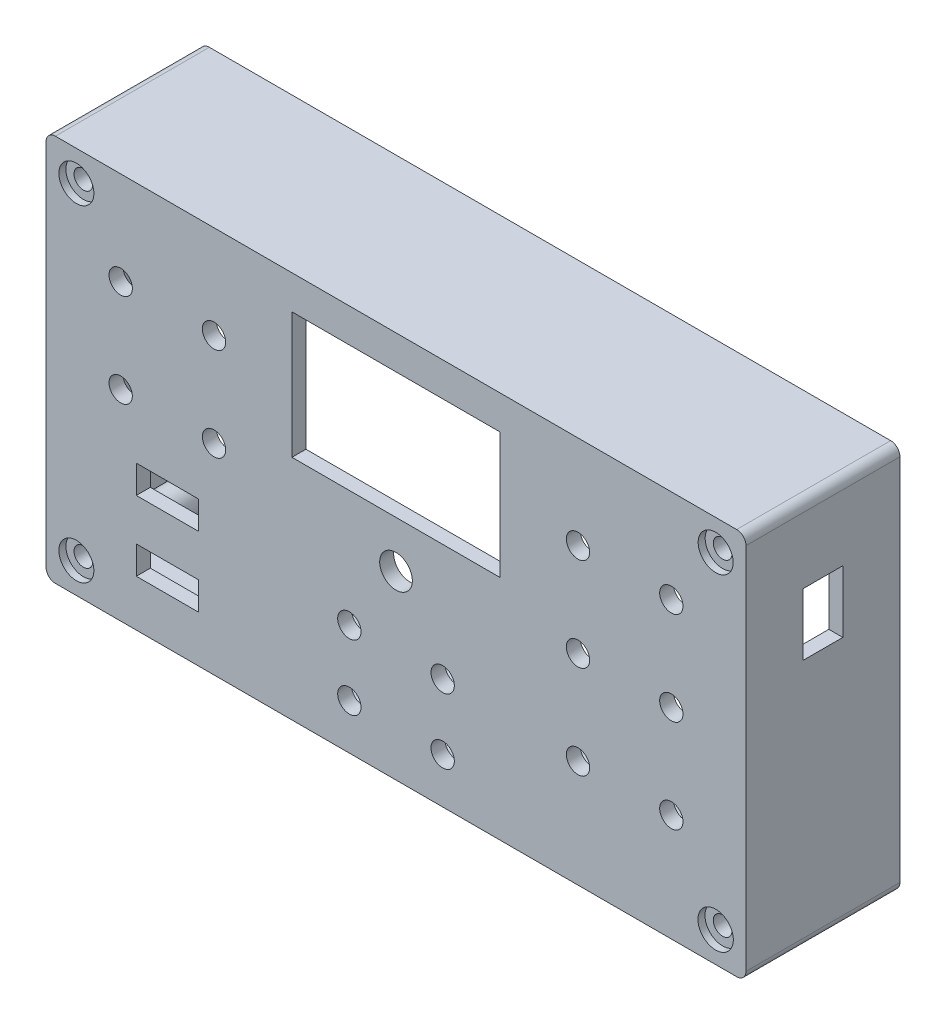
from build123d import *

# Parameters (mm, degrees)
CROQUIS1_W              = 150
CROQUIS1_H              = 83
SALIENTE_EXTRUIR1_DEPTH = 3
CROQUIS2_W              = 150
CROQUIS2_H              = 83
CROQUIS2_W_2            = 144
CROQUIS2_H_2            = 77
SALIENTE_EXTRUIR2_DEPTH = 30
CROQUIS4_R              = 2
SALIENTE_EXTRUIR8_DEPTH = 30
CORTAR_EXTRUIR1_START   = -3
CROQUIS5_R              = 2
CORTAR_EXTRUIR1_DEPTH   = 3
CROQUIS6_W              = 44.6
CROQUIS6_H              = 27
CORTAR_EXTRUIR2_DEPTH   = 3
CROQUIS7_R              = 3.5
CORTAR_EXTRUIR3_DEPTH   = 3
CROQUIS8_R              = 2.5
CORTAR_EXTRUIR4_DEPTH   = 3
CROQUIS9_R              = 2.5
CORTAR_EXTRUIR5_DEPTH   = 3
CROQUIS10_R             = 2.5
CORTAR_EXTRUIR6_DEPTH   = 3
CROQUIS11_W             = 13.3
CROQUIS11_H             = 6
CORTAR_EXTRUIR7_DEPTH   = 3
CROQUIS13_R             = 2
CORTAR_EXTRUIR8_DEPTH   = 3
CROQUIS14_R             = 3.75
CROQUIS14_R_2           = 2
CORTAR_EXTRUIR9_DEPTH   = 1.5
CROQUIS15_R             = 3.75
CROQUIS15_R_2           = 2
CROQUIS15_R_3           = 3.79
CORTAR_EXTRUIR10_DEPTH  = 1.5
REDONDEO1_R             = 2
CROQUIS16_W             = 8.5
CROQUIS16_H             = 13.3
CORTAR_EXTRUIR12_DEPTH  = 3


with BuildPart() as part:
    # Croquis1 → Saliente-Extruir1 (new body)
    with BuildSketch(Plane.XY):
        Rectangle(CROQUIS1_W, CROQUIS1_H)
    extrude(amount=-SALIENTE_EXTRUIR1_DEPTH)

    # Croquis2 → Saliente-Extruir2 (add)
    with BuildSketch(Plane(origin=(0, 0, -3), x_dir=(-1, 0, 0), z_dir=(0, 0, -1))):
        Rectangle(CROQUIS2_W, CROQUIS2_H)
        Rectangle(CROQUIS2_W_2, CROQUIS2_H_2, mode=Mode.SUBTRACT)
    extrude(amount=SALIENTE_EXTRUIR2_DEPTH)

    # Croquis4 → Saliente-Extruir8 (add)
    # profile 1 of 4: a face of its own
    with BuildSketch(Plane(origin=(0, 0, -3), x_dir=(-1, 0, 0), z_dir=(0, 0, -1))):
        with BuildLine():
            Line((-72, 35), (-72, 38.5))
            Line((-72, 38.5), (-68.5, 38.5))
            ThreePointArc((-68.5, 38.5), (-66.025126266, 32.525126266), (-72, 35))
        make_face()
        with Locations((-68.5, 35)):
            Circle(CROQUIS4_R, mode=Mode.SUBTRACT)
    # profile 2 of 4: a face of its own
    with BuildSketch(Plane(origin=(0, 0, -3), x_dir=(-1, 0, 0), z_dir=(0, 0, -1))):
        with BuildLine():
            Line((-72, -35), (-72, -38.5))
            Line((-72, -38.5), (-68.5, -38.5))
            ThreePointArc((-68.5, -38.5), (-66.025126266, -32.525126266), (-72, -35))
        make_face()
        with Locations(Location((-68.5, -35, 0), (0, 0, 180))):
            Circle(CROQUIS4_R, mode=Mode.SUBTRACT)
    # profile 3 of 4: a face of its own
    with BuildSketch(Plane(origin=(0, 0, -3), x_dir=(-1, 0, 0), z_dir=(0, 0, -1))):
        with BuildLine():
            Line((72, -35), (72, -38.5))
            Line((72, -38.5), (68.5, -38.5))
            ThreePointArc((68.5, -38.5), (66.025126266, -32.525126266), (72, -35))
        make_face()
        with Locations((68.5, -35)):
            Circle(CROQUIS4_R, mode=Mode.SUBTRACT)
    # profile 4 of 4: a face of its own
    with BuildSketch(Plane(origin=(0, 0, -3), x_dir=(-1, 0, 0), z_dir=(0, 0, -1))):
        with BuildLine():
            Line((68.5, 38.5), (72, 38.5))
            Line((72, 38.5), (72, 35))
            ThreePointArc((72, 35), (66.025126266, 32.525126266), (68.5, 38.5))
        make_face()
        with Locations(Location((68.5, 35, 0), (0, 0, 180))):
            Circle(CROQUIS4_R, mode=Mode.SUBTRACT)
    extrude(amount=SALIENTE_EXTRUIR8_DEPTH)

    # Croquis5 → Cortar-Extruir1 (cut)
    with BuildSketch(Plane(origin=(0, 0, -3), x_dir=(-1, 0, 0), z_dir=(0, 0, -1)).offset(CORTAR_EXTRUIR1_START)):
        with Locations((-68.5, 35)):
            Circle(CROQUIS5_R)
        with Locations(Location((-68.5, -35, 0), (0, 0, 180))):
            Circle(CROQUIS5_R)
        with Locations((68.5, -35)):
            Circle(CROQUIS5_R)
        with Locations(Location((68.5, 35, 0), (0, 0, 180))):
            Circle(CROQUIS5_R)
    extrude(amount=CORTAR_EXTRUIR1_DEPTH, mode=Mode.SUBTRACT)

    # Croquis6 → Cortar-Extruir2 (cut)
    with BuildSketch(Plane.XY):
        with Locations((0, 20.75)):
            Rectangle(CROQUIS6_W, CROQUIS6_H)
    extrude(amount=-CORTAR_EXTRUIR2_DEPTH, mode=Mode.SUBTRACT)

    # Croquis7 → Cortar-Extruir3 (cut)
    with BuildSketch(Plane.XY):
        with Locations((0, -2.75)):
            Circle(CROQUIS7_R)
    extrude(amount=-CORTAR_EXTRUIR3_DEPTH, mode=Mode.SUBTRACT)

    # Croquis8 → Cortar-Extruir4 (cut)
    with BuildSketch(Plane.XY):
        with Locations((-10, -17.75)):
            Circle(CROQUIS8_R)
        with Locations(Location((10, -17.75, 0), (0, 0, 180))):
            Circle(CROQUIS8_R)
    extrude(amount=-CORTAR_EXTRUIR4_DEPTH, mode=Mode.SUBTRACT)

    # Croquis9 → Cortar-Extruir5 (cut)
    with BuildSketch(Plane.XY):
        with Locations((-10, -31.75)):
            Circle(CROQUIS9_R)
        with Locations(Location((10, -31.75, 0), (0, 0, 180))):
            Circle(CROQUIS9_R)
    extrude(amount=-CORTAR_EXTRUIR5_DEPTH, mode=Mode.SUBTRACT)

    # Croquis10 → Cortar-Extruir6 (cut)
    with BuildSketch(Plane.XY):
        with Locations((39, 21.5)):
            Circle(CROQUIS10_R)
        with Locations((59, 21.5)):
            Circle(CROQUIS10_R)
        with Locations((59, 1.5)):
            Circle(CROQUIS10_R)
        with Locations((59, -18.5)):
            Circle(CROQUIS10_R)
        with Locations((39, 1.5)):
            Circle(CROQUIS10_R)
        with Locations((39, -18.5)):
            Circle(CROQUIS10_R)
        with Locations(Location((-39, 1.5, 0), (0, 0, 180))):
            Circle(CROQUIS10_R)
        with Locations(Location((-59, 1.5, 0), (0, 0, 180))):
            Circle(CROQUIS10_R)
        with Locations(Location((-59, 21.5, 0), (0, 0, 180))):
            Circle(CROQUIS10_R)
        with Locations(Location((-39, 21.5, 0), (0, 0, 180))):
            Circle(CROQUIS10_R)
    extrude(amount=-CORTAR_EXTRUIR6_DEPTH, mode=Mode.SUBTRACT)

    # Croquis11 → Cortar-Extruir7 (cut)
    with BuildSketch(Plane.XY):
        with Locations((-49, -13.5)):
            Rectangle(CROQUIS11_W, CROQUIS11_H)
        with Locations((-49, -28.5)):
            Rectangle(CROQUIS11_W, CROQUIS11_H)
    extrude(amount=-CORTAR_EXTRUIR7_DEPTH, mode=Mode.SUBTRACT)

    # Croquis13 → Cortar-Extruir8 (cut)
    with BuildSketch(Plane.XZ.offset(41.5)):
        with Locations((20.2, -26.15)):
            Circle(CROQUIS13_R)
        with Locations((53.2, -6.85)):
            Circle(CROQUIS13_R)
    extrude(amount=-CORTAR_EXTRUIR8_DEPTH, mode=Mode.SUBTRACT)

    # Croquis14 → Cortar-Extruir9 (cut)
    # profile 1 of 2: a face of its own
    with BuildSketch(Plane.XZ.offset(41.5)):
        with Locations((53.2, -6.85)):
            Circle(CROQUIS14_R)
        with Locations((53.2, -6.85)):
            Circle(CROQUIS14_R_2, mode=Mode.SUBTRACT)
    # profile 2 of 2: a face of its own
    with BuildSketch(Plane.XZ.offset(41.5)):
        with Locations((20.2, -26.15)):
            Circle(CROQUIS14_R)
        with Locations((20.2, -26.15)):
            Circle(CROQUIS14_R_2, mode=Mode.SUBTRACT)
    extrude(amount=-CORTAR_EXTRUIR9_DEPTH, mode=Mode.SUBTRACT)

    # Croquis15 → Cortar-Extruir10 (cut)
    # profile 1 of 4: a face of its own
    with BuildSketch(Plane.XY):
        with Locations((-68.5, 35)):
            Circle(CROQUIS15_R)
        with Locations((-68.5, 35)):
            Circle(CROQUIS15_R_2, mode=Mode.SUBTRACT)
    # profile 2 of 4: a face of its own
    with BuildSketch(Plane.XY):
        with Locations((-68.5, -35)):
            Circle(CROQUIS15_R)
        with Locations((-68.5, -35)):
            Circle(CROQUIS15_R_2, mode=Mode.SUBTRACT)
    # profile 3 of 4: a face of its own
    with BuildSketch(Plane.XY):
        with Locations((68.5, -35)):
            Circle(CROQUIS15_R_3)
        with Locations((68.5, -35)):
            Circle(CROQUIS15_R_2, mode=Mode.SUBTRACT)
    # profile 4 of 4: a face of its own
    with BuildSketch(Plane.XY):
        with Locations((68.5, 35)):
            Circle(CROQUIS15_R)
        with Locations((68.5, 35)):
            Circle(CROQUIS15_R_2, mode=Mode.SUBTRACT)
    extrude(amount=-CORTAR_EXTRUIR10_DEPTH, mode=Mode.SUBTRACT)

    # Redondeo1
    redondeo1_edges = [part.edges().sort_by_distance(p)[0] for p in [
        (-75, 41.5, -16.5),
        (75, 41.5, -16.5),
        (75, -41.5, -16.5),
        (-75, -41.5, -16.5),
    ]]
    fillet(redondeo1_edges, radius=REDONDEO1_R)

    # Croquis16 → Cortar-Extruir12 (cut)
    with BuildSketch(Plane(origin=(75, 0, 0), x_dir=(0, 0, -1), z_dir=(1, 0, 0))):
        with Locations((16.5, 18.75)):
            Rectangle(CROQUIS16_W, CROQUIS16_H)
    extrude(amount=-CORTAR_EXTRUIR12_DEPTH, mode=Mode.SUBTRACT)


solid = part.part
